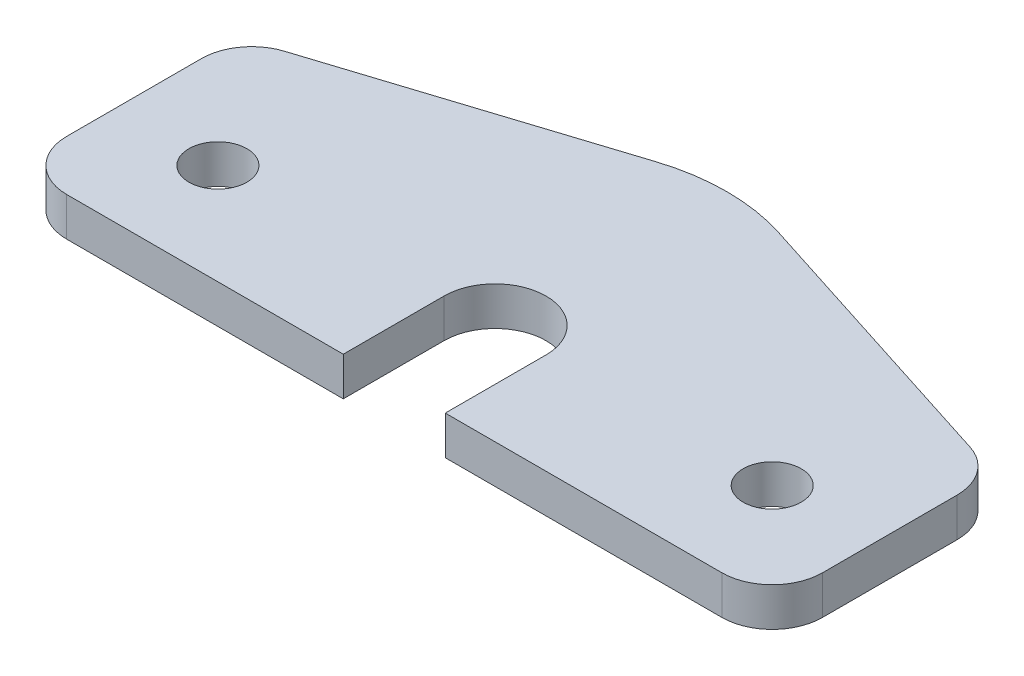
from build123d import *

# Parameters (mm, degrees)
SKETCH1_R           = 1.8288
BOSS_EXTRUDE1_DEPTH = 2.4384
FILLET1_R           = 3.175


with BuildPart() as part:
    # Sketch1 → Boss-Extrude1 (new body)
    with BuildSketch(Plane(origin=(0, 0, 0), x_dir=(1, 0, 0), z_dir=(0, 1, 0))):
        with BuildLine():
            Line((-23.8125, -6.35), (-3.2131, -6.35))
            Line((-3.2131, -6.35), (-3.2131, 0))
            ThreePointArc((-3.2131, 0), (0, 3.2131), (3.2131, 0))
            Line((3.2131, 0), (3.2131, -6.35))
            Line((3.2131, -6.35), (23.8125, -6.35))
            Line((23.8125, -6.35), (23.8125, 7.62))
            Line((23.8125, 7.62), (3.870318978, 14.000893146))
            ThreePointArc((3.870318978, 14.000893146), (0, 14.605), (-3.870318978, 14.000893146))
            Line((-3.870318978, 14.000893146), (-23.8125, 7.62))
            Line((-23.8125, 7.62), (-23.8125, -6.35))
        make_face()
        with Locations(Location((17.4625, 0, 0), (0, 0, 270))):
            Circle(SKETCH1_R, mode=Mode.SUBTRACT)
        with Locations(Location((-17.4625, 0, 0), (0, 0, 90))):
            Circle(SKETCH1_R, mode=Mode.SUBTRACT)
    extrude(amount=BOSS_EXTRUDE1_DEPTH)

    # Fillet1
    fillet1_edges = [part.edges().sort_by_distance(p)[0] for p in [
        (-23.8125, 1.2192, 6.35),
        (-23.8125, 1.2192, -7.62),
        (23.8125, 1.2192, -7.62),
        (23.8125, 1.2192, 6.35),
    ]]
    fillet(fillet1_edges, radius=FILLET1_R)


solid = part.part
